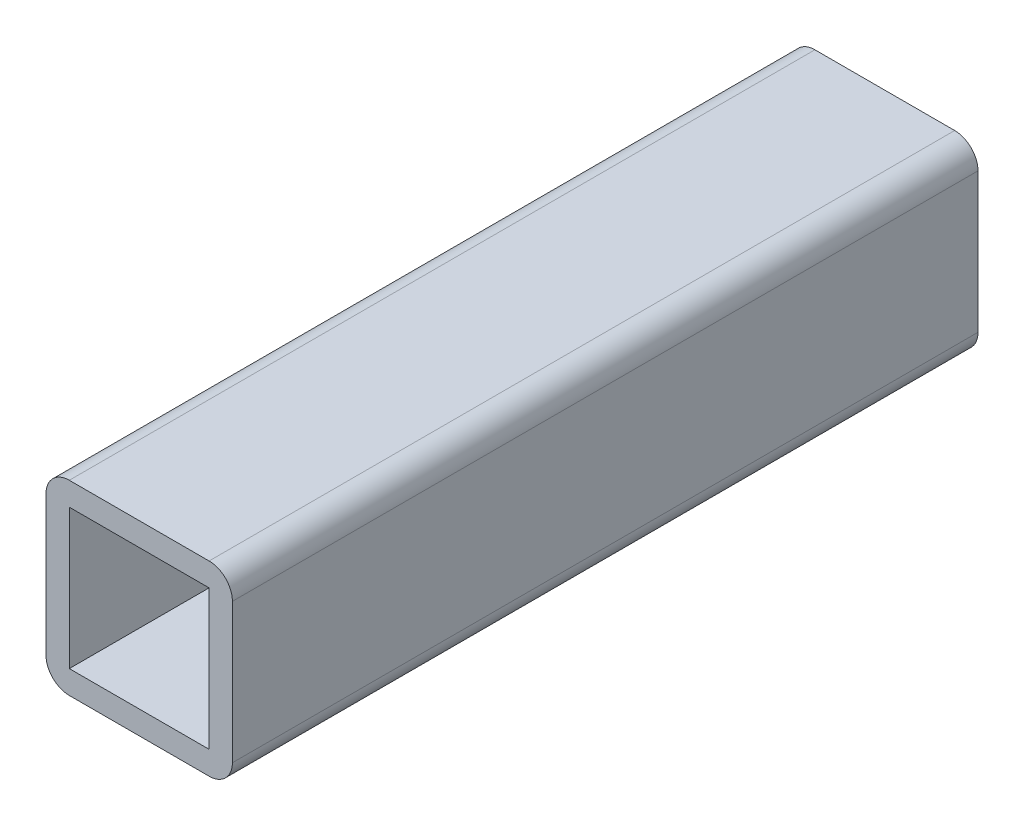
from build123d import *

# Parameters (mm, degrees)
SKETCH1_W           = 38.1
SKETCH1_H           = 38.1
BOSS_EXTRUDE1_DEPTH = 203.2


with BuildPart() as part:
    # Sketch1 → Boss-Extrude1 (new body)
    with BuildSketch(Plane.XY):
        with BuildLine():
            Line((-19.05, -25.4), (19.05, -25.4))
            ThreePointArc((19.05, -25.4), (23.540128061, -23.540128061), (25.4, -19.05))
            Line((25.4, -19.05), (25.4, 19.05))
            ThreePointArc((25.4, 19.05), (23.540128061, 23.540128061), (19.05, 25.4))
            Line((19.05, 25.4), (-19.05, 25.4))
            ThreePointArc((-19.05, 25.4), (-23.540128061, 23.540128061), (-25.4, 19.05))
            Line((-25.4, 19.05), (-25.4, -19.05))
            ThreePointArc((-25.4, -19.05), (-23.540128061, -23.540128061), (-19.05, -25.4))
        make_face()
        Rectangle(SKETCH1_W, SKETCH1_H, mode=Mode.SUBTRACT)
    extrude(amount=-BOSS_EXTRUDE1_DEPTH)


solid = part.part
